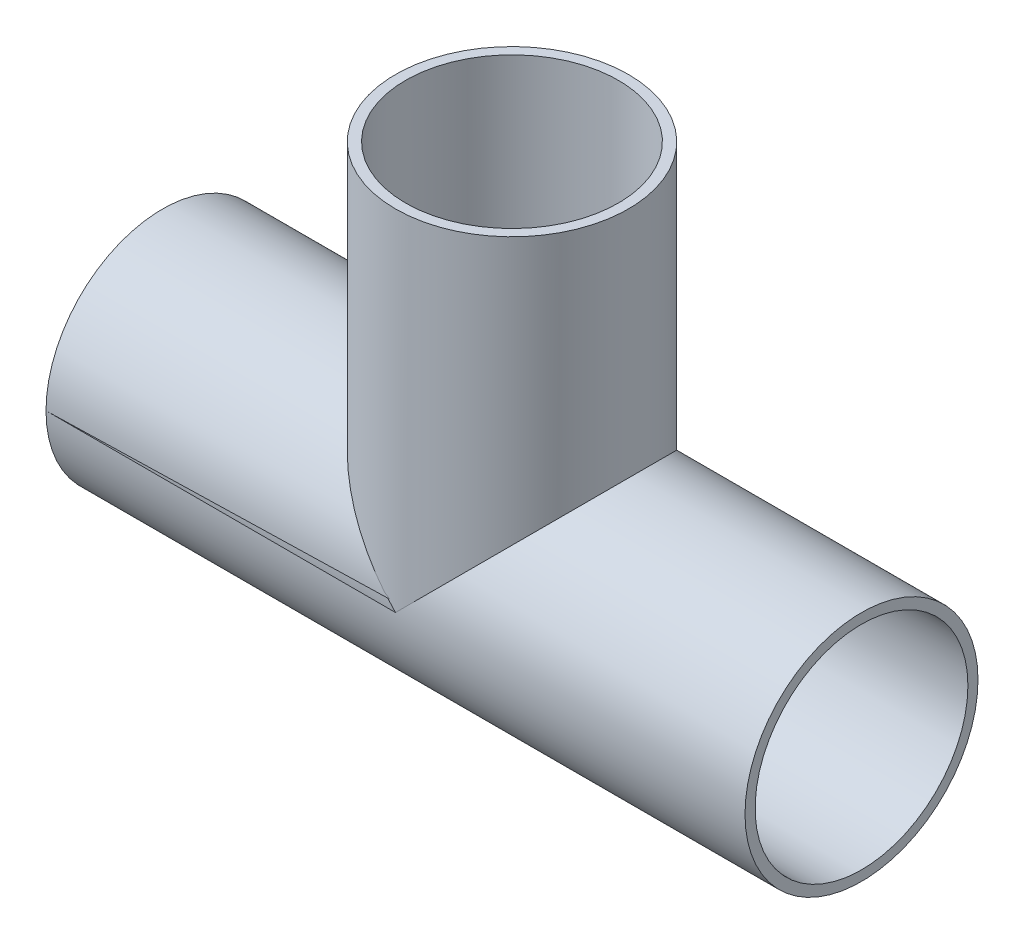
from build123d import *

# Parameters (mm, degrees)
SKETCH1_R           = 19.05
BOSS_EXTRUDE1_DEPTH = 57.15
SKETCH2_R           = 19.05
BOSS_EXTRUDE2_DEPTH = 57.15
SKETCH3_R           = 17.399
CUT_EXTRUDE1_DEPTH  = 57.15
SKETCH4_R           = 17.399
CUT_EXTRUDE2_DEPTH  = 130.203386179


with BuildPart() as part:
    # Sketch1 → Boss-Extrude1 (new body)
    with BuildSketch(Plane(origin=(0, 0, 0), x_dir=(1, 0, 0), z_dir=(0, 1, 0))):
        with Locations(Location((0, 0, 0), (0, 0, 270))):
            Circle(SKETCH1_R)
    extrude(amount=BOSS_EXTRUDE1_DEPTH)

    # Sketch2 → Boss-Extrude2 (add, symmetric)
    with BuildSketch(Plane(origin=(0, 0, 0), x_dir=(0, 0, -1), z_dir=(1, 0, 0))):
        Circle(SKETCH2_R)
    extrude(amount=BOSS_EXTRUDE2_DEPTH, both=True)

    # Sketch3 → Cut-Extrude1 (cut)
    with BuildSketch(Plane(origin=(0, 57.15, 0), x_dir=(1, 0, 0), z_dir=(0, 1, 0))):
        with Locations(Location((0, 0, 0), (0, 0, 270))):
            Circle(SKETCH3_R)
    extrude(amount=-CUT_EXTRUDE1_DEPTH, mode=Mode.SUBTRACT)

    # Sketch4 → Cut-Extrude2 (cut, through all)
    with BuildSketch(Plane(origin=(57.15, 0, 0), x_dir=(0, 0, -1), z_dir=(1, 0, 0))):
        Circle(SKETCH4_R)
    extrude(amount=-CUT_EXTRUDE2_DEPTH, mode=Mode.SUBTRACT)


solid = part.part
